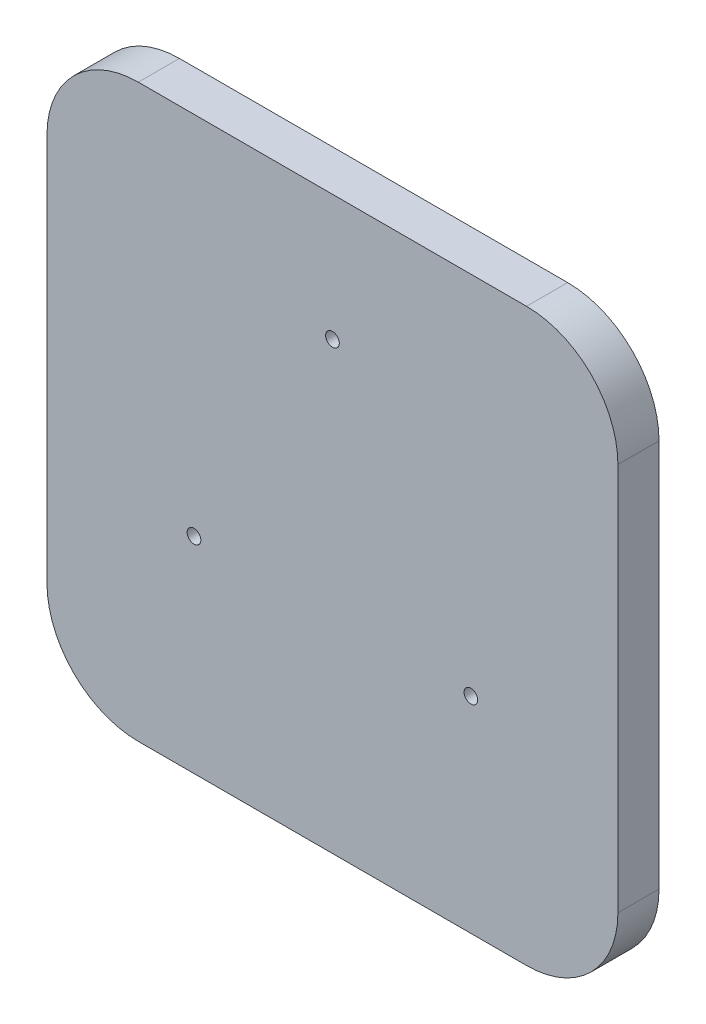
from build123d import *

# Parameters (mm, degrees)
ESQUISSE1_W             = 250
ESQUISSE1_H             = 250
BOSS_EXTRU_1_DEPTH      = 18
ESQUISSE2_R             = 3
ENL_V_MAT_EXTRU_1_DEPTH = 18
CONG_1_R                = 40


with BuildPart() as part:
    # Esquisse1 → Boss.-Extru.1 (new body)
    with BuildSketch(Plane.XY):
        with Locations((125, 125)):
            Rectangle(ESQUISSE1_W, ESQUISSE1_H)
    extrude(amount=BOSS_EXTRU_1_DEPTH)

    # Esquisse2 → Enl_v. mat.-Extru.1 (cut)
    with BuildSketch(Plane.XY.offset(18)):
        with Locations((125, 195)):
            Circle(ESQUISSE2_R)
        with Locations((185.621778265, 90)):
            Circle(ESQUISSE2_R)
        with Locations((64.378221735, 90)):
            Circle(ESQUISSE2_R)
    extrude(amount=-ENL_V_MAT_EXTRU_1_DEPTH, mode=Mode.SUBTRACT)

    # Cong_1
    cong_1_edges = [part.edges().sort_by_distance(p)[0] for p in [
        (0, 250, 9),
        (250, 250, 9),
        (250, 0, 9),
        (0, 0, 9),
    ]]
    fillet(cong_1_edges, radius=CONG_1_R)


solid = part.part
